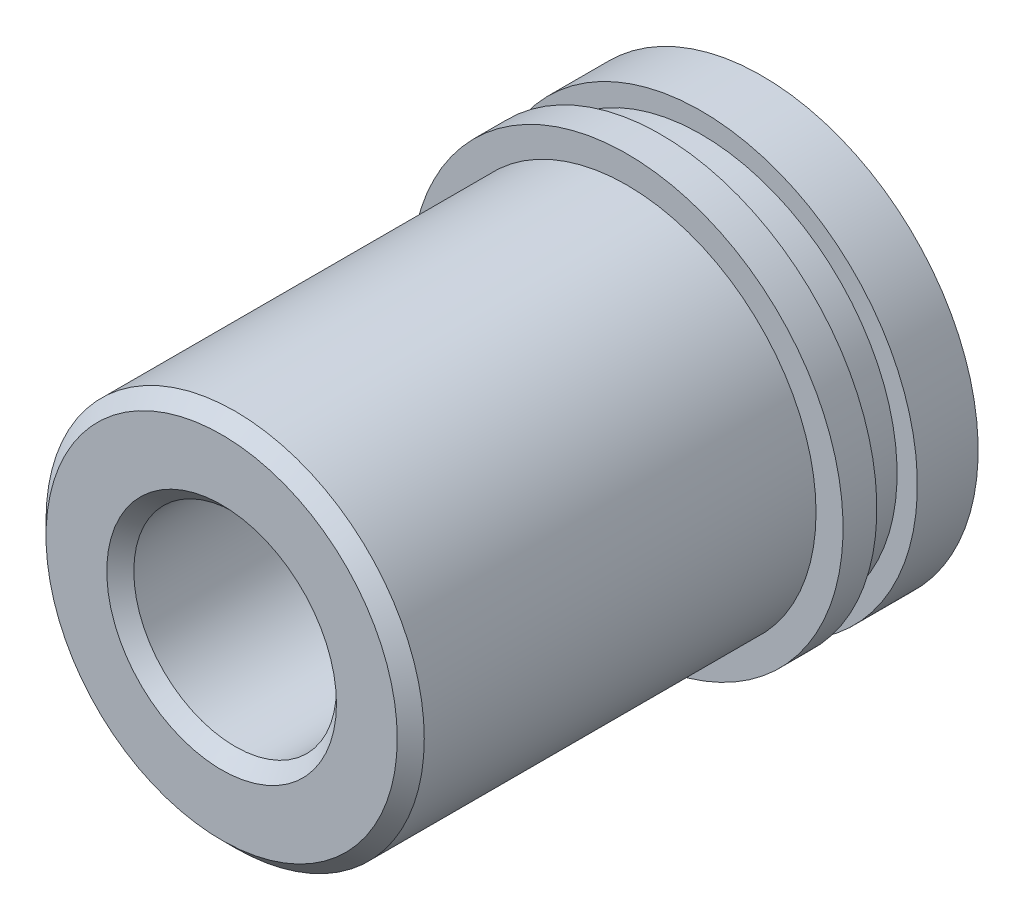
from build123d import *

# Parameters (mm, degrees)
CHANF_1_SIZE = 1


with BuildPart() as part:
    # Esquisse1 → Bague (revolve)
    with BuildSketch(Plane(origin=(0, 0, 0), x_dir=(1, 0, 0), z_dir=(0, 1, 0))):
        Polygon((-7.5, 10), (-16, 10), (-16, 5.5), (-14.5, 5.5), (-14.5, 2.5), (-16, 2.5), (-16, 0), (-14, 0), (-14, -30), (-7.5, -30), align=None)
    revolve(axis=Axis((0, 0, -19.957142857), (0, 0, 1)))

    # Chanf 1
    chanf_1_edges = [part.edges().sort_by_distance(p)[0] for p in [
        (7.5, 0, -10),
        (14, 0, 30),
        (7.5, 0, 30),
    ]]
    chamfer(chanf_1_edges, length=CHANF_1_SIZE)


solid = part.part
